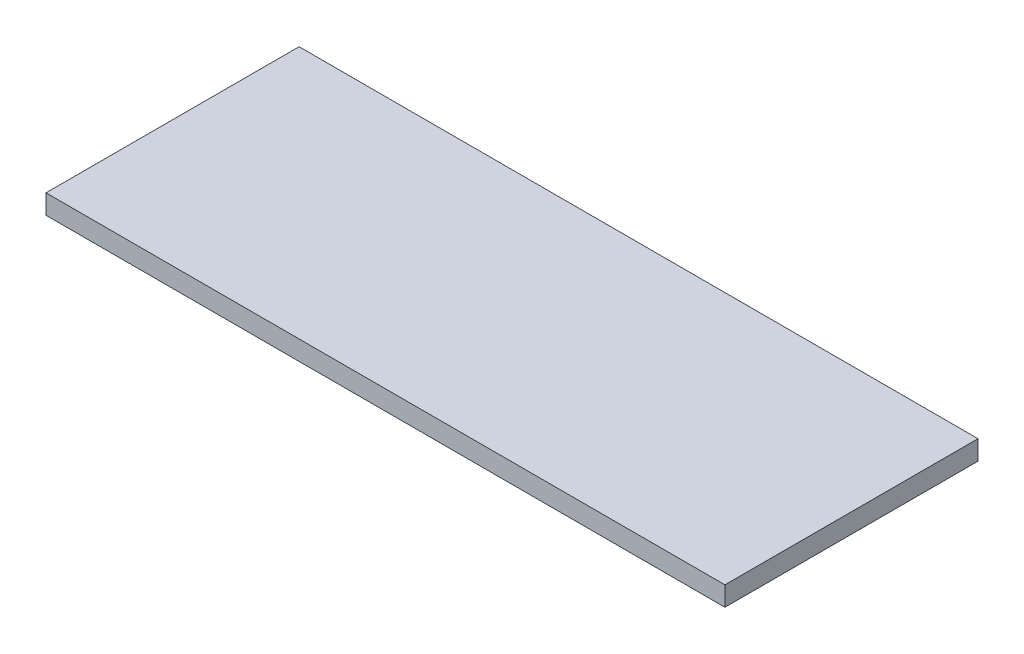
from build123d import *

# Parameters (mm, degrees)
SKETCH1_W           = 110.7313
SKETCH1_H           = 41.275
BOSS_EXTRUDE1_DEPTH = 3.175


with BuildPart() as part:
    # Sketch1 → Boss-Extrude1 (new body)
    with BuildSketch(Plane(origin=(0, 0, 0), x_dir=(1, 0, 0), z_dir=(0, 1, 0))):
        Rectangle(SKETCH1_W, SKETCH1_H)
    extrude(amount=BOSS_EXTRUDE1_DEPTH)


solid = part.part
